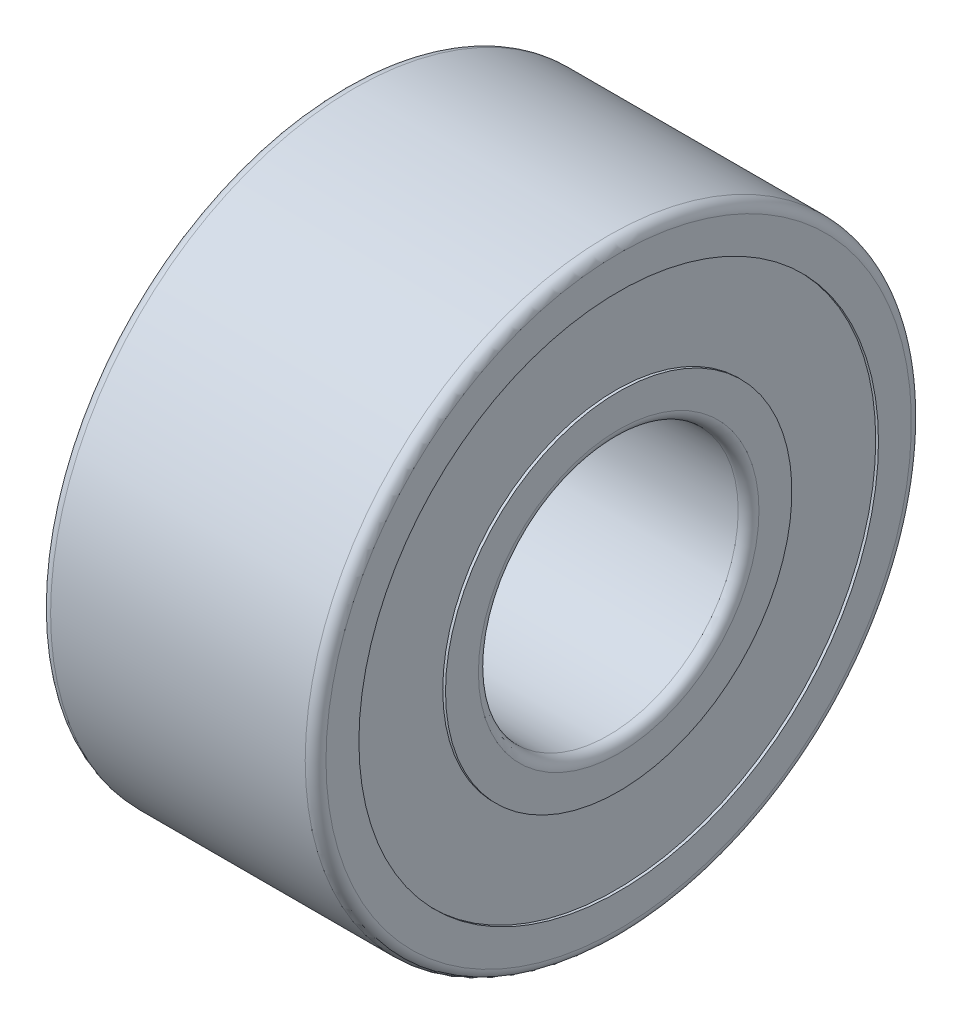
ISO-10303-21;
HEADER;
FILE_DESCRIPTION(('STEP AP214'),'2;1');
FILE_NAME('part.step','',(''),(''),'','','');
FILE_SCHEMA(('AUTOMOTIVE_DESIGN { 1 0 10303 214 1 1 1 1 }'));
ENDSEC;
DATA;
#1=APPLICATION_CONTEXT('core data for automotive mechanical design processes');
#2=APPLICATION_PROTOCOL_DEFINITION('international standard','automotive_design',2000,#1);
#3=PRODUCT_CONTEXT('',#1,'mechanical');
#4=PRODUCT('Part','Part','',(#3));
#5=PRODUCT_RELATED_PRODUCT_CATEGORY('part','',(#4));
#6=PRODUCT_DEFINITION_FORMATION('','',#4);
#7=PRODUCT_DEFINITION_CONTEXT('part definition',#1,'design');
#8=PRODUCT_DEFINITION('design','',#6,#7);
#9=PRODUCT_DEFINITION_SHAPE('','',#8);
#10=(LENGTH_UNIT() NAMED_UNIT(*) SI_UNIT(.MILLI.,.METRE.));
#11=(NAMED_UNIT(*) PLANE_ANGLE_UNIT() SI_UNIT($,.RADIAN.));
#12=(NAMED_UNIT(*) SI_UNIT($,.STERADIAN.) SOLID_ANGLE_UNIT());
#13=UNCERTAINTY_MEASURE_WITH_UNIT(LENGTH_MEASURE(1.E-05),#10,'distance_accuracy_value','');
#14=(GEOMETRIC_REPRESENTATION_CONTEXT(3) GLOBAL_UNCERTAINTY_ASSIGNED_CONTEXT((#13)) GLOBAL_UNIT_ASSIGNED_CONTEXT((#10,
#11,#12)) REPRESENTATION_CONTEXT('',''));
#15=CARTESIAN_POINT('',(0.,0.,0.));
#16=DIRECTION('',(0.,0.,1.));
#17=DIRECTION('',(1.,0.,0.));
#18=AXIS2_PLACEMENT_3D('',#15,#16,#17);
#19=CARTESIAN_POINT('',(-7.87050001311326,-73.5000146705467,35.));
#20=DIRECTION('',(-1.,0.,0.));
#21=DIRECTION('',(0.,0.,1.));
#22=AXIS2_PLACEMENT_3D('',#19,#20,#21);
#23=CYLINDRICAL_SURFACE('',#22,15.);
#24=CARTESIAN_POINT('',(-7.95000001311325,-73.5000146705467,35.));
#25=DIRECTION('',(-1.,0.,0.));
#26=DIRECTION('',(0.,0.,1.));
#27=AXIS2_PLACEMENT_3D('',#24,#25,#26);
#28=CIRCLE('',#27,15.);
#29=CARTESIAN_POINT('',(-7.95000001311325,-73.5000146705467,50.));
#30=VERTEX_POINT('',#29);
#31=EDGE_CURVE('E8',#30,#30,#28,.T.);
#32=ORIENTED_EDGE('',*,*,#31,.T.);
#33=EDGE_LOOP('',(#32));
#34=FACE_BOUND('',#33,.T.);
#35=CARTESIAN_POINT('',(-7.79100001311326,-73.5000146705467,35.));
#36=DIRECTION('',(-1.,0.,0.));
#37=DIRECTION('',(0.,0.,1.));
#38=AXIS2_PLACEMENT_3D('',#35,#36,#37);
#39=CIRCLE('',#38,15.);
#40=CARTESIAN_POINT('',(-7.79100001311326,-73.5000146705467,50.));
#41=VERTEX_POINT('',#40);
#42=EDGE_CURVE('E29',#41,#41,#39,.T.);
#43=ORIENTED_EDGE('',*,*,#42,.F.);
#44=EDGE_LOOP('',(#43));
#45=FACE_BOUND('',#44,.T.);
#46=ADVANCED_FACE('F13',(#34,#45),#23,.F.);
#47=CARTESIAN_POINT('',(-7.87050001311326,-73.5000146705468,35.));
#48=DIRECTION('',(-1.,0.,0.));
#49=DIRECTION('',(0.,0.,1.));
#50=AXIS2_PLACEMENT_3D('',#47,#48,#49);
#51=CYLINDRICAL_SURFACE('',#50,9.99999999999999);
#52=CARTESIAN_POINT('',(-7.95000001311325,-73.5000146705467,35.));
#53=DIRECTION('',(-1.,0.,0.));
#54=DIRECTION('',(0.,0.,1.));
#55=AXIS2_PLACEMENT_3D('',#52,#53,#54);
#56=CIRCLE('',#55,10.);
#57=CARTESIAN_POINT('',(-7.95000001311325,-73.5000146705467,45.));
#58=VERTEX_POINT('',#57);
#59=EDGE_CURVE('E32',#58,#58,#56,.T.);
#60=ORIENTED_EDGE('',*,*,#59,.F.);
#61=EDGE_LOOP('',(#60));
#62=FACE_BOUND('',#61,.T.);
#63=CARTESIAN_POINT('',(-7.79100001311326,-73.5000146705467,35.));
#64=DIRECTION('',(-1.,0.,0.));
#65=DIRECTION('',(0.,0.,1.));
#66=AXIS2_PLACEMENT_3D('',#63,#64,#65);
#67=CIRCLE('',#66,10.);
#68=CARTESIAN_POINT('',(-7.79100001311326,-73.5000146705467,45.));
#69=VERTEX_POINT('',#68);
#70=EDGE_CURVE('E21',#69,#69,#67,.T.);
#71=ORIENTED_EDGE('',*,*,#70,.T.);
#72=EDGE_LOOP('',(#71));
#73=FACE_BOUND('',#72,.T.);
#74=ADVANCED_FACE('F98',(#62,#73),#51,.T.);
#75=CARTESIAN_POINT('',(-7.35000001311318,-73.5000146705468,35.0000000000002));
#76=DIRECTION('',(-1.,0.,0.));
#77=DIRECTION('',(0.,0.,1.));
#78=AXIS2_PLACEMENT_3D('',#75,#76,#77);
#79=TOROIDAL_SURFACE('',#78,8.0999999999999,0.60000000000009);
#80=CARTESIAN_POINT('',(-7.35000001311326,-73.5000146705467,35.));
#81=DIRECTION('',(-1.,0.,0.));
#82=DIRECTION('',(0.,0.,1.));
#83=AXIS2_PLACEMENT_3D('',#80,#81,#82);
#84=CIRCLE('',#83,7.5);
#85=CARTESIAN_POINT('',(-7.35000001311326,-73.5000146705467,42.5));
#86=VERTEX_POINT('',#85);
#87=EDGE_CURVE('E36',#86,#86,#84,.T.);
#88=ORIENTED_EDGE('',*,*,#87,.F.);
#89=EDGE_LOOP('',(#88));
#90=FACE_BOUND('',#89,.T.);
#91=CARTESIAN_POINT('',(-7.95000001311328,-73.5000146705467,35.));
#92=DIRECTION('',(-1.,0.,0.));
#93=DIRECTION('',(0.,0.,1.));
#94=AXIS2_PLACEMENT_3D('',#91,#92,#93);
#95=CIRCLE('',#94,8.10000000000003);
#96=CARTESIAN_POINT('',(-7.95000001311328,-73.5000146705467,43.1));
#97=VERTEX_POINT('',#96);
#98=EDGE_CURVE('E26',#97,#97,#95,.T.);
#99=ORIENTED_EDGE('',*,*,#98,.T.);
#100=EDGE_LOOP('',(#99));
#101=FACE_BOUND('',#100,.T.);
#102=ADVANCED_FACE('F103',(#90,#101),#79,.T.);
#103=CARTESIAN_POINT('',(-1.31132593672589E-08,-73.5000146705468,35.));
#104=DIRECTION('',(-1.,0.,0.));
#105=DIRECTION('',(0.,0.,1.));
#106=AXIS2_PLACEMENT_3D('',#103,#104,#105);
#107=CYLINDRICAL_SURFACE('',#106,7.5);
#108=ORIENTED_EDGE('',*,*,#87,.T.);
#109=EDGE_LOOP('',(#108));
#110=FACE_BOUND('',#109,.T.);
#111=CARTESIAN_POINT('',(7.34999998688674,-73.5000146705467,35.));
#112=DIRECTION('',(-1.,0.,0.));
#113=DIRECTION('',(0.,0.,1.));
#114=AXIS2_PLACEMENT_3D('',#111,#112,#113);
#115=CIRCLE('',#114,7.5);
#116=CARTESIAN_POINT('',(7.34999998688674,-73.5000146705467,42.5));
#117=VERTEX_POINT('',#116);
#118=EDGE_CURVE('E39',#117,#117,#115,.T.);
#119=ORIENTED_EDGE('',*,*,#118,.F.);
#120=EDGE_LOOP('',(#119));
#121=FACE_BOUND('',#120,.T.);
#122=ADVANCED_FACE('F108',(#110,#121),#107,.F.);
#123=CARTESIAN_POINT('',(7.34999998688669,-73.5000146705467,34.9999999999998));
#124=DIRECTION('',(-1.,0.,0.));
#125=DIRECTION('',(0.,1.,0.));
#126=AXIS2_PLACEMENT_3D('',#123,#124,#125);
#127=TOROIDAL_SURFACE('',#126,8.10000000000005,0.600000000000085);
#128=CARTESIAN_POINT('',(7.94999998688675,-73.5000146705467,35.));
#129=DIRECTION('',(-1.,0.,0.));
#130=DIRECTION('',(0.,0.,1.));
#131=AXIS2_PLACEMENT_3D('',#128,#129,#130);
#132=CIRCLE('',#131,8.10000000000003);
#133=CARTESIAN_POINT('',(7.94999998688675,-73.5000146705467,43.1));
#134=VERTEX_POINT('',#133);
#135=EDGE_CURVE('E34',#134,#134,#132,.T.);
#136=ORIENTED_EDGE('',*,*,#135,.F.);
#137=EDGE_LOOP('',(#136));
#138=FACE_BOUND('',#137,.T.);
#139=ORIENTED_EDGE('',*,*,#118,.T.);
#140=EDGE_LOOP('',(#139));
#141=FACE_BOUND('',#140,.T.);
#142=ADVANCED_FACE('F95',(#138,#141),#127,.T.);
#143=CARTESIAN_POINT('',(7.87049998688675,-73.5000146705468,35.));
#144=DIRECTION('',(-1.,0.,0.));
#145=DIRECTION('',(0.,0.,1.));
#146=AXIS2_PLACEMENT_3D('',#143,#144,#145);
#147=CYLINDRICAL_SURFACE('',#146,9.99999999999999);
#148=CARTESIAN_POINT('',(7.79099998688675,-73.5000146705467,35.));
#149=DIRECTION('',(-1.,0.,0.));
#150=DIRECTION('',(0.,0.,1.));
#151=AXIS2_PLACEMENT_3D('',#148,#149,#150);
#152=CIRCLE('',#151,10.);
#153=CARTESIAN_POINT('',(7.79099998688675,-73.5000146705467,45.));
#154=VERTEX_POINT('',#153);
#155=EDGE_CURVE('E47',#154,#154,#152,.T.);
#156=ORIENTED_EDGE('',*,*,#155,.F.);
#157=EDGE_LOOP('',(#156));
#158=FACE_BOUND('',#157,.T.);
#159=CARTESIAN_POINT('',(7.94999998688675,-73.5000146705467,35.));
#160=DIRECTION('',(-1.,0.,0.));
#161=DIRECTION('',(0.,0.,1.));
#162=AXIS2_PLACEMENT_3D('',#159,#160,#161);
#163=CIRCLE('',#162,10.);
#164=CARTESIAN_POINT('',(7.94999998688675,-73.5000146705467,45.));
#165=VERTEX_POINT('',#164);
#166=EDGE_CURVE('E44',#165,#165,#163,.T.);
#167=ORIENTED_EDGE('',*,*,#166,.T.);
#168=EDGE_LOOP('',(#167));
#169=FACE_BOUND('',#168,.T.);
#170=ADVANCED_FACE('F89',(#158,#169),#147,.T.);
#171=CARTESIAN_POINT('',(7.87049998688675,-73.5000146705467,35.));
#172=DIRECTION('',(-1.,0.,0.));
#173=DIRECTION('',(0.,0.,1.));
#174=AXIS2_PLACEMENT_3D('',#171,#172,#173);
#175=CYLINDRICAL_SURFACE('',#174,15.);
#176=CARTESIAN_POINT('',(7.79099998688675,-73.5000146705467,35.));
#177=DIRECTION('',(-1.,0.,0.));
#178=DIRECTION('',(0.,0.,1.));
#179=AXIS2_PLACEMENT_3D('',#176,#177,#178);
#180=CIRCLE('',#179,15.);
#181=CARTESIAN_POINT('',(7.79099998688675,-73.5000146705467,50.));
#182=VERTEX_POINT('',#181);
#183=EDGE_CURVE('E53',#182,#182,#180,.T.);
#184=ORIENTED_EDGE('',*,*,#183,.T.);
#185=EDGE_LOOP('',(#184));
#186=FACE_BOUND('',#185,.T.);
#187=CARTESIAN_POINT('',(7.94999998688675,-73.5000146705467,35.));
#188=DIRECTION('',(-1.,0.,0.));
#189=DIRECTION('',(0.,0.,1.));
#190=AXIS2_PLACEMENT_3D('',#187,#188,#189);
#191=CIRCLE('',#190,15.);
#192=CARTESIAN_POINT('',(7.94999998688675,-73.5000146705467,50.));
#193=VERTEX_POINT('',#192);
#194=EDGE_CURVE('E50',#193,#193,#191,.T.);
#195=ORIENTED_EDGE('',*,*,#194,.F.);
#196=EDGE_LOOP('',(#195));
#197=FACE_BOUND('',#196,.T.);
#198=ADVANCED_FACE('F15',(#186,#197),#175,.F.);
#199=CARTESIAN_POINT('',(7.34999998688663,-73.5000146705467,34.9999999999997));
#200=DIRECTION('',(-1.,0.,0.));
#201=DIRECTION('',(0.,1.,0.));
#202=AXIS2_PLACEMENT_3D('',#199,#200,#201);
#203=TOROIDAL_SURFACE('',#202,16.9000000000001,0.600000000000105);
#204=CARTESIAN_POINT('',(7.34999998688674,-73.5000146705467,35.));
#205=DIRECTION('',(-1.,0.,0.));
#206=DIRECTION('',(0.,0.,1.));
#207=AXIS2_PLACEMENT_3D('',#204,#205,#206);
#208=CIRCLE('',#207,17.5);
#209=CARTESIAN_POINT('',(7.34999998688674,-73.5000146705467,52.5));
#210=VERTEX_POINT('',#209);
#211=EDGE_CURVE('E60',#210,#210,#208,.T.);
#212=ORIENTED_EDGE('',*,*,#211,.F.);
#213=EDGE_LOOP('',(#212));
#214=FACE_BOUND('',#213,.T.);
#215=CARTESIAN_POINT('',(7.94999998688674,-73.5000146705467,35.));
#216=DIRECTION('',(-1.,0.,0.));
#217=DIRECTION('',(0.,0.,1.));
#218=AXIS2_PLACEMENT_3D('',#215,#216,#217);
#219=CIRCLE('',#218,16.9);
#220=CARTESIAN_POINT('',(7.94999998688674,-73.5000146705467,51.9));
#221=VERTEX_POINT('',#220);
#222=EDGE_CURVE('E56',#221,#221,#219,.T.);
#223=ORIENTED_EDGE('',*,*,#222,.T.);
#224=EDGE_LOOP('',(#223));
#225=FACE_BOUND('',#224,.T.);
#226=ADVANCED_FACE('F72',(#214,#225),#203,.T.);
#227=CARTESIAN_POINT('',(-1.3113260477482E-08,-73.5000146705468,35.));
#228=DIRECTION('',(-1.,0.,0.));
#229=DIRECTION('',(0.,0.,1.));
#230=AXIS2_PLACEMENT_3D('',#227,#228,#229);
#231=CYLINDRICAL_SURFACE('',#230,17.5);
#232=CARTESIAN_POINT('',(-7.35000001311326,-73.5000146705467,35.));
#233=DIRECTION('',(-1.,0.,0.));
#234=DIRECTION('',(0.,0.,1.));
#235=AXIS2_PLACEMENT_3D('',#232,#233,#234);
#236=CIRCLE('',#235,17.5);
#237=CARTESIAN_POINT('',(-7.35000001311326,-73.5000146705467,52.5));
#238=VERTEX_POINT('',#237);
#239=EDGE_CURVE('E59',#238,#238,#236,.T.);
#240=ORIENTED_EDGE('',*,*,#239,.F.);
#241=EDGE_LOOP('',(#240));
#242=FACE_BOUND('',#241,.T.);
#243=ORIENTED_EDGE('',*,*,#211,.T.);
#244=EDGE_LOOP('',(#243));
#245=FACE_BOUND('',#244,.T.);
#246=ADVANCED_FACE('F69',(#242,#245),#231,.T.);
#247=CARTESIAN_POINT('',(-7.35000001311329,-73.5000146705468,34.9999999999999));
#248=DIRECTION('',(-1.,0.,0.));
#249=DIRECTION('',(0.,1.,0.));
#250=AXIS2_PLACEMENT_3D('',#247,#248,#249);
#251=TOROIDAL_SURFACE('',#250,16.9,0.599999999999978);
#252=CARTESIAN_POINT('',(-7.95000001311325,-73.5000146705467,35.));
#253=DIRECTION('',(-1.,0.,0.));
#254=DIRECTION('',(0.,0.,1.));
#255=AXIS2_PLACEMENT_3D('',#252,#253,#254);
#256=CIRCLE('',#255,16.9);
#257=CARTESIAN_POINT('',(-7.95000001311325,-73.5000146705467,51.9));
#258=VERTEX_POINT('',#257);
#259=EDGE_CURVE('E17',#258,#258,#256,.T.);
#260=ORIENTED_EDGE('',*,*,#259,.F.);
#261=EDGE_LOOP('',(#260));
#262=FACE_BOUND('',#261,.T.);
#263=ORIENTED_EDGE('',*,*,#239,.T.);
#264=EDGE_LOOP('',(#263));
#265=FACE_BOUND('',#264,.T.);
#266=ADVANCED_FACE('F67',(#262,#265),#251,.T.);
#267=CARTESIAN_POINT('',(7.94999998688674,-90.4000146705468,35.));
#268=DIRECTION('',(1.,0.,0.));
#269=DIRECTION('',(0.,1.,0.));
#270=AXIS2_PLACEMENT_3D('',#267,#268,#269);
#271=PLANE('',#270);
#272=ORIENTED_EDGE('',*,*,#222,.F.);
#273=EDGE_LOOP('',(#272));
#274=FACE_BOUND('',#273,.T.);
#275=ORIENTED_EDGE('',*,*,#194,.T.);
#276=EDGE_LOOP('',(#275));
#277=FACE_BOUND('',#276,.T.);
#278=ADVANCED_FACE('F81',(#274,#277),#271,.T.);
#279=CARTESIAN_POINT('',(7.79099998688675,-88.5000146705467,35.));
#280=DIRECTION('',(1.,0.,0.));
#281=DIRECTION('',(0.,1.,0.));
#282=AXIS2_PLACEMENT_3D('',#279,#280,#281);
#283=PLANE('',#282);
#284=ORIENTED_EDGE('',*,*,#183,.F.);
#285=EDGE_LOOP('',(#284));
#286=FACE_BOUND('',#285,.T.);
#287=ORIENTED_EDGE('',*,*,#155,.T.);
#288=EDGE_LOOP('',(#287));
#289=FACE_BOUND('',#288,.T.);
#290=ADVANCED_FACE('F84',(#286,#289),#283,.T.);
#291=CARTESIAN_POINT('',(7.94999998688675,-83.5000146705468,35.));
#292=DIRECTION('',(1.,0.,0.));
#293=DIRECTION('',(0.,1.,0.));
#294=AXIS2_PLACEMENT_3D('',#291,#292,#293);
#295=PLANE('',#294);
#296=ORIENTED_EDGE('',*,*,#166,.F.);
#297=EDGE_LOOP('',(#296));
#298=FACE_BOUND('',#297,.T.);
#299=ORIENTED_EDGE('',*,*,#135,.T.);
#300=EDGE_LOOP('',(#299));
#301=FACE_BOUND('',#300,.T.);
#302=ADVANCED_FACE('F123',(#298,#301),#295,.T.);
#303=CARTESIAN_POINT('',(-7.95000001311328,-83.5000146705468,35.));
#304=DIRECTION('',(-1.,0.,0.));
#305=DIRECTION('',(0.,-1.,0.));
#306=AXIS2_PLACEMENT_3D('',#303,#304,#305);
#307=PLANE('',#306);
#308=ORIENTED_EDGE('',*,*,#59,.T.);
#309=EDGE_LOOP('',(#308));
#310=FACE_BOUND('',#309,.T.);
#311=ORIENTED_EDGE('',*,*,#98,.F.);
#312=EDGE_LOOP('',(#311));
#313=FACE_BOUND('',#312,.T.);
#314=ADVANCED_FACE('F119',(#310,#313),#307,.T.);
#315=CARTESIAN_POINT('',(-7.79100001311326,-88.5000146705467,35.));
#316=DIRECTION('',(-1.,0.,0.));
#317=DIRECTION('',(0.,-1.,0.));
#318=AXIS2_PLACEMENT_3D('',#315,#316,#317);
#319=PLANE('',#318);
#320=ORIENTED_EDGE('',*,*,#42,.T.);
#321=EDGE_LOOP('',(#320));
#322=FACE_BOUND('',#321,.T.);
#323=ORIENTED_EDGE('',*,*,#70,.F.);
#324=EDGE_LOOP('',(#323));
#325=FACE_BOUND('',#324,.T.);
#326=ADVANCED_FACE('F115',(#322,#325),#319,.T.);
#327=CARTESIAN_POINT('',(-7.95000001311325,-90.4000146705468,35.));
#328=DIRECTION('',(-1.,0.,0.));
#329=DIRECTION('',(0.,-1.,0.));
#330=AXIS2_PLACEMENT_3D('',#327,#328,#329);
#331=PLANE('',#330);
#332=ORIENTED_EDGE('',*,*,#259,.T.);
#333=EDGE_LOOP('',(#332));
#334=FACE_BOUND('',#333,.T.);
#335=ORIENTED_EDGE('',*,*,#31,.F.);
#336=EDGE_LOOP('',(#335));
#337=FACE_BOUND('',#336,.T.);
#338=ADVANCED_FACE('F112',(#334,#337),#331,.T.);
#339=CLOSED_SHELL('',(#46,#74,#102,#122,#142,#170,#198,#226,#246,#266,#278,#290,#302,#314,#326,#338));
#340=MANIFOLD_SOLID_BREP('B1',#339);
#341=ADVANCED_BREP_SHAPE_REPRESENTATION('',(#18,#340),#14);
#342=SHAPE_DEFINITION_REPRESENTATION(#9,#341);
ENDSEC;
END-ISO-10303-21;
